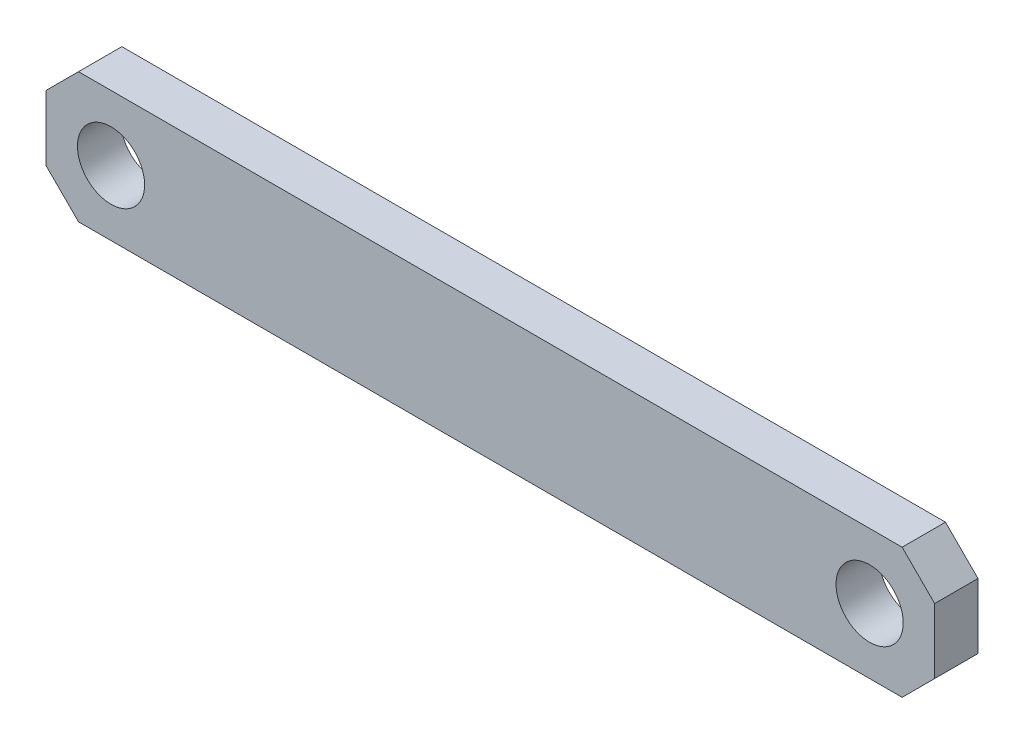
from build123d import *

# Parameters (mm, degrees)
LINK_PITCH70_DEPTH     = 2
SKETCH_2_R             = 3.1
PIVOT_BORES_D6_2_DEPTH = 250


with BuildPart() as part:
    # Sketch 1 → Link_Pitch70 (new, symmetric)
    with BuildSketch(Plane.XY):
        Polygon((-6, -3), (-3, -6), (73, -6), (76, -3), (76, 3), (73, 6), (-3, 6), (-6, 3), align=None)
    extrude(amount=LINK_PITCH70_DEPTH, both=True)

    # Sketch 2 → Pivot_Bores_D6_2 (cut, symmetric)
    with BuildSketch(Plane.XY):
        Circle(SKETCH_2_R)
        with Locations((70, 0)):
            Circle(SKETCH_2_R)
    extrude(amount=PIVOT_BORES_D6_2_DEPTH, both=True, mode=Mode.SUBTRACT)


solid = part.part
